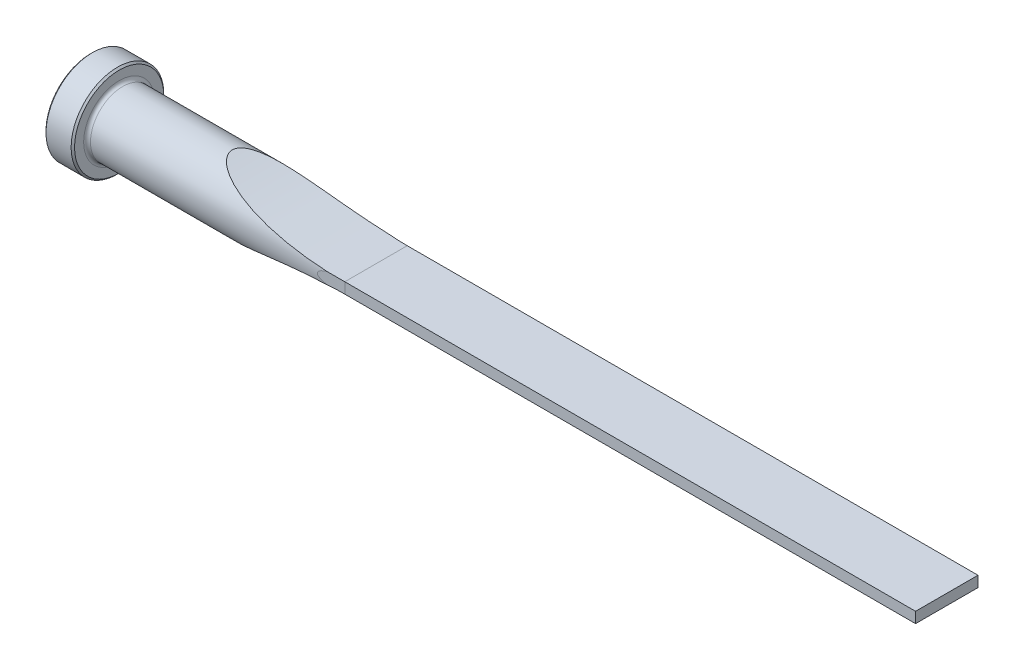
ISO-10303-21;
HEADER;
FILE_DESCRIPTION(('STEP AP214'),'2;1');
FILE_NAME('part.step','',(''),(''),'','','');
FILE_SCHEMA(('AUTOMOTIVE_DESIGN { 1 0 10303 214 1 1 1 1 }'));
ENDSEC;
DATA;
#1=APPLICATION_CONTEXT('core data for automotive mechanical design processes');
#2=APPLICATION_PROTOCOL_DEFINITION('international standard','automotive_design',2000,#1);
#3=PRODUCT_CONTEXT('',#1,'mechanical');
#4=PRODUCT('Part','Part','',(#3));
#5=PRODUCT_RELATED_PRODUCT_CATEGORY('part','',(#4));
#6=PRODUCT_DEFINITION_FORMATION('','',#4);
#7=PRODUCT_DEFINITION_CONTEXT('part definition',#1,'design');
#8=PRODUCT_DEFINITION('design','',#6,#7);
#9=PRODUCT_DEFINITION_SHAPE('','',#8);
#10=(LENGTH_UNIT() NAMED_UNIT(*) SI_UNIT(.MILLI.,.METRE.));
#11=(NAMED_UNIT(*) PLANE_ANGLE_UNIT() SI_UNIT($,.RADIAN.));
#12=(NAMED_UNIT(*) SI_UNIT($,.STERADIAN.) SOLID_ANGLE_UNIT());
#13=UNCERTAINTY_MEASURE_WITH_UNIT(LENGTH_MEASURE(1.E-05),#10,'distance_accuracy_value','');
#14=(GEOMETRIC_REPRESENTATION_CONTEXT(3) GLOBAL_UNCERTAINTY_ASSIGNED_CONTEXT((#13)) GLOBAL_UNIT_ASSIGNED_CONTEXT((#10,
#11,#12)) REPRESENTATION_CONTEXT('',''));
#15=CARTESIAN_POINT('',(0.,0.,0.));
#16=DIRECTION('',(0.,0.,1.));
#17=DIRECTION('',(1.,0.,0.));
#18=AXIS2_PLACEMENT_3D('',#15,#16,#17);
#19=CARTESIAN_POINT('',(0.,0.,0.));
#20=DIRECTION('',(-1.,0.,0.));
#21=DIRECTION('',(0.,0.,1.));
#22=AXIS2_PLACEMENT_3D('',#19,#20,#21);
#23=CYLINDRICAL_SURFACE('',#22,7.14375);
#24=CARTESIAN_POINT('',(7.112,0.,0.));
#25=DIRECTION('',(-1.,0.,0.));
#26=DIRECTION('',(0.,0.,1.));
#27=AXIS2_PLACEMENT_3D('',#24,#25,#26);
#28=CIRCLE('',#27,7.14375);
#29=CARTESIAN_POINT('',(7.112,0.,7.14375));
#30=VERTEX_POINT('',#29);
#31=EDGE_CURVE('E153',#30,#30,#28,.F.);
#32=ORIENTED_EDGE('',*,*,#31,.T.);
#33=EDGE_LOOP('',(#32));
#34=FACE_BOUND('',#33,.T.);
#35=CARTESIAN_POINT('',(63.5,1.66545622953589,6.94690000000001));
#36=CARTESIAN_POINT('',(63.2602205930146,1.66539130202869,6.9468983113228));
#37=CARTESIAN_POINT('',(63.0204291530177,1.66140650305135,6.94787008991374));
#38=CARTESIAN_POINT('',(62.5409765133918,1.64513557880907,6.95174989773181));
#39=CARTESIAN_POINT('',(62.3013155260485,1.63284358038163,6.95465929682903));
#40=CARTESIAN_POINT('',(61.8211110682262,1.59939046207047,6.96242801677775));
#41=CARTESIAN_POINT('',(61.5805715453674,1.57817397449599,6.96729950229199));
#42=CARTESIAN_POINT('',(61.100708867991,1.52578189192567,6.97895857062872));
#43=CARTESIAN_POINT('',(60.8613853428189,1.49460954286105,6.98574552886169));
#44=CARTESIAN_POINT('',(60.3341219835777,1.41275931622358,7.00282004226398));
#45=CARTESIAN_POINT('',(60.046591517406,1.35935208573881,7.01354421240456));
#46=CARTESIAN_POINT('',(59.6193276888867,1.26169102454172,7.03152533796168));
#47=CARTESIAN_POINT('',(59.4775502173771,1.22620337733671,7.03783632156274));
#48=CARTESIAN_POINT('',(59.1960773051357,1.14791266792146,7.05103266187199));
#49=CARTESIAN_POINT('',(59.0563810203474,1.10511266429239,7.05791777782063));
#50=CARTESIAN_POINT('',(58.7797072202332,1.00972668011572,7.07219584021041));
#51=CARTESIAN_POINT('',(58.6427427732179,0.957102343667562,7.07959070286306));
#52=CARTESIAN_POINT('',(58.3751712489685,0.838413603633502,7.09463865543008));
#53=CARTESIAN_POINT('',(58.2445402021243,0.772405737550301,7.10229054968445));
#54=CARTESIAN_POINT('',(58.0346934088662,0.642339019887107,7.11501322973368));
#55=CARTESIAN_POINT('',(57.952121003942,0.584056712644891,7.12014673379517));
#56=CARTESIAN_POINT('',(57.8379827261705,0.48446373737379,7.12738091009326));
#57=CARTESIAN_POINT('',(57.801394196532,0.449023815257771,7.12972544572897));
#58=CARTESIAN_POINT('',(57.7337306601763,0.373169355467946,7.13409783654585));
#59=CARTESIAN_POINT('',(57.7026400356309,0.332769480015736,7.13612658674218));
#60=CARTESIAN_POINT('',(57.6599545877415,0.263678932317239,7.13892891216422));
#61=CARTESIAN_POINT('',(57.6455334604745,0.236759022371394,7.13988012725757));
#62=CARTESIAN_POINT('',(57.6208913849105,0.181039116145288,7.14150989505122));
#63=CARTESIAN_POINT('',(57.610665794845,0.152241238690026,7.142188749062));
#64=CARTESIAN_POINT('',(57.5953440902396,0.0929451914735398,7.14320728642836));
#65=CARTESIAN_POINT('',(57.5903022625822,0.0624324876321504,7.14354337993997));
#66=CARTESIAN_POINT('',(57.5862149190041,0.00100805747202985,7.1438157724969));
#67=CARTESIAN_POINT('',(57.5871656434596,-0.0299034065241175,7.14375232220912));
#68=CARTESIAN_POINT('',(57.5944670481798,-0.0874662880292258,7.14326597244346));
#69=CARTESIAN_POINT('',(57.6001902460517,-0.114201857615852,7.14288484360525));
#70=CARTESIAN_POINT('',(57.6156498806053,-0.166474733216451,7.14185795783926));
#71=CARTESIAN_POINT('',(57.6253896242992,-0.192011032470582,7.14121198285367));
#72=CARTESIAN_POINT('',(57.6541940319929,-0.254728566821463,7.13930814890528));
#73=CARTESIAN_POINT('',(57.6754634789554,-0.29088512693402,7.13790755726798));
#74=CARTESIAN_POINT('',(57.7232657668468,-0.359496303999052,7.13478175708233));
#75=CARTESIAN_POINT('',(57.7498129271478,-0.39194046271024,7.13305566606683));
#76=CARTESIAN_POINT('',(57.8310525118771,-0.480375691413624,7.12781634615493));
#77=CARTESIAN_POINT('',(57.8901250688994,-0.53227243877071,7.12405564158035));
#78=CARTESIAN_POINT('',(58.0145571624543,-0.627749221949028,7.11627461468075));
#79=CARTESIAN_POINT('',(58.0799370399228,-0.671300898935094,7.11225346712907));
#80=CARTESIAN_POINT('',(58.2535094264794,-0.775899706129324,7.10178396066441));
#81=CARTESIAN_POINT('',(58.3644424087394,-0.83234654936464,7.09528710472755));
#82=CARTESIAN_POINT('',(58.590985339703,-0.935122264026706,7.08246694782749));
#83=CARTESIAN_POINT('',(58.7066056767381,-0.981427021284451,7.07614409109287));
#84=CARTESIAN_POINT('',(58.9416713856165,-1.06691744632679,7.06376189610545));
#85=CARTESIAN_POINT('',(59.0611424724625,-1.10603221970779,7.05770558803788));
#86=CARTESIAN_POINT('',(59.3017233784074,-1.17826382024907,7.04600484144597));
#87=CARTESIAN_POINT('',(59.4228312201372,-1.21138729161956,7.04035995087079));
#88=CARTESIAN_POINT('',(59.7104613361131,-1.28394915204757,7.02754987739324));
#89=CARTESIAN_POINT('',(59.8775128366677,-1.32131606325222,7.02057652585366));
#90=CARTESIAN_POINT('',(60.2131128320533,-1.38885630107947,7.00752462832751));
#91=CARTESIAN_POINT('',(60.3816617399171,-1.41902757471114,7.00144633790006));
#92=CARTESIAN_POINT('',(60.8894036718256,-1.50059649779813,6.98459356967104));
#93=CARTESIAN_POINT('',(61.2301123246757,-1.54291316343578,6.97522715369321));
#94=CARTESIAN_POINT('',(61.8927532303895,-1.60644233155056,6.96084942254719));
#95=CARTESIAN_POINT('',(62.2145799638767,-1.62877275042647,6.95560971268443));
#96=CARTESIAN_POINT('',(62.6971835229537,-1.65088759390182,6.9503801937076));
#97=CARTESIAN_POINT('',(62.8577023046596,-1.65636275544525,6.94907536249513));
#98=CARTESIAN_POINT('',(63.1788130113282,-1.66364180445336,6.94733518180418));
#99=CARTESIAN_POINT('',(63.3394049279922,-1.66544603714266,6.94689975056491));
#100=CARTESIAN_POINT('',(63.5,-1.66545622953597,6.9469));
#101=B_SPLINE_CURVE_WITH_KNOTS('',3,(#35,#36,#37,#38,#39,#40,#41,#42,#43,#44,#45,#46,#47,#48,
#49,#50,#51,#52,#53,#54,#55,#56,#57,#58,#59,#60,#61,#62,#63,#64,#65,#66,#67,#68,#69,#70,#71,#72,
#73,#74,#75,#76,#77,#78,#79,#80,#81,#82,#83,#84,#85,#86,#87,#88,#89,#90,#91,#92,#93,#94,#95,#96,
#97,#98,#99,#100),.UNSPECIFIED.,.F.,.F.,(4,2,2,2,2,2,2,2,2,2,2,2,2,2,2,2,2,2,2,2,2,2,2,2,2,2,2,
2,2,2,2,2,4),(0.,0.719321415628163,1.43915192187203,2.1635157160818,2.88764358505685,
3.76473487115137,4.20345743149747,4.64199693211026,5.08228579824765,5.52075206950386,
5.82287393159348,5.97551162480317,6.12770850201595,6.21909711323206,6.31038434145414,
6.40261812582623,6.49479405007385,6.57646960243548,6.65821253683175,6.78340264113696,
6.90893716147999,7.14377497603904,7.37939720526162,7.75236878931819,8.12621776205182,
8.50357546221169,8.88051208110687,9.39425854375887,9.90815140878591,10.9377202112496,
11.905257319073,12.3870700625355,12.8688374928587),.UNSPECIFIED.);
#102=CARTESIAN_POINT('',(59.6824678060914,1.27580380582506,7.02890380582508));
#103=VERTEX_POINT('',#102);
#104=CARTESIAN_POINT('',(59.682467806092,-1.27580380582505,7.02890380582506));
#105=VERTEX_POINT('',#104);
#106=EDGE_CURVE('E156',#103,#105,#101,.T.);
#107=ORIENTED_EDGE('',*,*,#106,.F.);
#108=CARTESIAN_POINT('',(63.5,1.19379999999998,7.04329508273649));
#109=CARTESIAN_POINT('',(62.9119073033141,1.19379905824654,7.04326293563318));
#110=CARTESIAN_POINT('',(62.3238139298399,1.19963550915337,7.04230480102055));
#111=CARTESIAN_POINT('',(61.147862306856,1.22297656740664,7.03830622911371));
#112=CARTESIAN_POINT('',(60.5600040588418,1.24048124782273,7.03526577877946));
#113=CARTESIAN_POINT('',(59.3842156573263,1.28717401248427,7.02686830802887));
#114=CARTESIAN_POINT('',(58.7962859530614,1.31637303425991,7.02150911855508));
#115=CARTESIAN_POINT('',(57.6211537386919,1.3864405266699,7.00801172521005));
#116=CARTESIAN_POINT('',(57.0339512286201,1.42730899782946,6.99987352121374));
#117=CARTESIAN_POINT('',(55.8411697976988,1.52223591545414,6.97985621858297));
#118=CARTESIAN_POINT('',(55.2356238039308,1.57668506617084,6.96786255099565));
#119=CARTESIAN_POINT('',(54.0258834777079,1.69798189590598,6.93930152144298));
#120=CARTESIAN_POINT('',(53.4216891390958,1.76482951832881,6.92273418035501));
#121=CARTESIAN_POINT('',(52.2154317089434,1.91082359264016,6.88386679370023));
#122=CARTESIAN_POINT('',(51.6133673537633,1.98996073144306,6.86157108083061));
#123=CARTESIAN_POINT('',(50.4112885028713,2.16050629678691,6.80979606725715));
#124=CARTESIAN_POINT('',(49.8112739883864,2.25191461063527,6.78031683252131));
#125=CARTESIAN_POINT('',(48.6130545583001,2.44702193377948,6.71237198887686));
#126=CARTESIAN_POINT('',(48.0148524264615,2.55073461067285,6.67389633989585));
#127=CARTESIAN_POINT('',(46.8214510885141,2.77024013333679,6.58581270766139));
#128=CARTESIAN_POINT('',(46.2262520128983,2.88603349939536,6.53620424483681));
#129=CARTESIAN_POINT('',(45.0380738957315,3.12980759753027,6.42305161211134));
#130=CARTESIAN_POINT('',(44.4451043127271,3.25781849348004,6.35947241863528));
#131=CARTESIAN_POINT('',(43.2639538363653,3.52545085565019,6.21510165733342));
#132=CARTESIAN_POINT('',(42.6757723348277,3.66507082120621,6.13431231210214));
#133=CARTESIAN_POINT('',(41.5131384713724,3.95355540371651,5.95242394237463));
#134=CARTESIAN_POINT('',(40.9386072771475,4.10227433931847,5.85160590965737));
#135=CARTESIAN_POINT('',(40.0826508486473,4.33293916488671,5.68048477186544));
#136=CARTESIAN_POINT('',(39.7982124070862,4.41111893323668,5.62010546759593));
#137=CARTESIAN_POINT('',(39.2316985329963,4.5698498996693,5.49181853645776));
#138=CARTESIAN_POINT('',(38.9496230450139,4.65040104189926,5.4239110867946));
#139=CARTESIAN_POINT('',(38.3895967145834,4.81330810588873,5.27986701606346));
#140=CARTESIAN_POINT('',(38.1116328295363,4.89565395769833,5.20376990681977));
#141=CARTESIAN_POINT('',(37.5590817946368,5.06226454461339,5.04183965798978));
#142=CARTESIAN_POINT('',(37.2844950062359,5.14652948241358,4.95600548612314));
#143=CARTESIAN_POINT('',(36.7398901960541,5.31651649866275,4.77319412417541));
#144=CARTESIAN_POINT('',(36.4698671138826,5.40223671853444,4.67623035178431));
#145=CARTESIAN_POINT('',(35.9352688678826,5.57472288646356,4.46920643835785));
#146=CARTESIAN_POINT('',(35.6706919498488,5.6614884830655,4.35915059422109));
#147=CARTESIAN_POINT('',(35.2934899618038,5.78711094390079,4.18888285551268));
#148=CARTESIAN_POINT('',(35.1780006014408,5.82584051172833,4.13489357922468));
#149=CARTESIAN_POINT('',(34.9486393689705,5.9032752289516,4.02356829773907));
#150=CARTESIAN_POINT('',(34.8347675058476,5.94198037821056,3.96623227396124));
#151=CARTESIAN_POINT('',(34.4957464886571,6.05797268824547,3.7886915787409));
#152=CARTESIAN_POINT('',(34.2733429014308,6.13508637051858,3.66302145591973));
#153=CARTESIAN_POINT('',(33.8400092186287,6.28719330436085,3.39528037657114));
#154=CARTESIAN_POINT('',(33.6290126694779,6.36219724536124,3.2533240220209));
#155=CARTESIAN_POINT('',(33.2211558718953,6.50882325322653,2.9490535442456));
#156=CARTESIAN_POINT('',(33.0242752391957,6.58045014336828,2.78676974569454));
#157=CARTESIAN_POINT('',(32.6993304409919,6.69985198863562,2.48282459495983));
#158=CARTESIAN_POINT('',(32.5666416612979,6.74900302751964,2.34669268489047));
#159=CARTESIAN_POINT('',(32.3164585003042,6.84228622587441,2.05893016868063));
#160=CARTESIAN_POINT('',(32.1989863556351,6.88641102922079,1.90727744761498));
#161=CARTESIAN_POINT('',(31.9841157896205,6.96755633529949,1.58560790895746));
#162=CARTESIAN_POINT('',(31.8869668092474,7.00448821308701,1.41539796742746));
#163=CARTESIAN_POINT('',(31.7229006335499,7.06709481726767,1.05911389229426));
#164=CARTESIAN_POINT('',(31.6558957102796,7.0928022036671,0.873087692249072));
#165=CARTESIAN_POINT('',(31.5725421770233,7.12483655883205,0.538927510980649));
#166=CARTESIAN_POINT('',(31.5476265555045,7.13443643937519,0.393250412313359));
#167=CARTESIAN_POINT('',(31.5213405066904,7.14456514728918,0.0994665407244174));
#168=CARTESIAN_POINT('',(31.5199580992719,7.14509859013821,-0.0486389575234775));
#169=CARTESIAN_POINT('',(31.5408681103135,7.13704021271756,-0.342727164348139));
#170=CARTESIAN_POINT('',(31.5631380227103,7.12845706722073,-0.488711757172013));
#171=CARTESIAN_POINT('',(31.6292179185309,7.10305066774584,-0.774951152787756));
#172=CARTESIAN_POINT('',(31.673045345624,7.08622074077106,-0.915201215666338));
#173=CARTESIAN_POINT('',(31.7990758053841,7.03799063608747,-1.23934078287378));
#174=CARTESIAN_POINT('',(31.8895352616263,7.00348317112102,-1.41953152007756));
#175=CARTESIAN_POINT('',(32.0960814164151,6.92519979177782,-1.76236227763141));
#176=CARTESIAN_POINT('',(32.212230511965,6.88140132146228,-1.92495810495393));
#177=CARTESIAN_POINT('',(32.4418899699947,6.79544293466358,-2.20751319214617));
#178=CARTESIAN_POINT('',(32.552627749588,6.75422152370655,-2.3300664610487));
#179=CARTESIAN_POINT('',(32.7838482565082,6.66872452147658,-2.56454034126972));
#180=CARTESIAN_POINT('',(32.9043379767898,6.62444674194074,-2.67645319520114));
#181=CARTESIAN_POINT('',(33.1529845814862,6.53372451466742,-2.89087879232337));
#182=CARTESIAN_POINT('',(33.2811551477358,6.4872762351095,-2.99337388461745));
#183=CARTESIAN_POINT('',(33.5433224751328,6.39298230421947,-3.18979651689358));
#184=CARTESIAN_POINT('',(33.6773180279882,6.34513694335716,-3.28372582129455));
#185=CARTESIAN_POINT('',(33.9575388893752,6.24586449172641,-3.46900486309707));
#186=CARTESIAN_POINT('',(34.1040302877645,6.19438593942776,-3.55992249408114));
#187=CARTESIAN_POINT('',(34.4012101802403,6.09085223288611,-3.73429297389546));
#188=CARTESIAN_POINT('',(34.5518996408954,6.03879694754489,-3.81774408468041));
#189=CARTESIAN_POINT('',(35.0093003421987,5.88219893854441,-4.05828445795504));
#190=CARTESIAN_POINT('',(35.321133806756,5.7772986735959,-4.20542598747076));
#191=CARTESIAN_POINT('',(35.9548917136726,5.56813043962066,-4.47869136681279));
#192=CARTESIAN_POINT('',(36.2768390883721,5.46386466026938,-4.6047626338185));
#193=CARTESIAN_POINT('',(36.7648386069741,5.30895287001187,-4.78061129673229));
#194=CARTESIAN_POINT('',(36.9283148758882,5.25757459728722,-4.8370068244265));
#195=CARTESIAN_POINT('',(37.2567824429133,5.15539227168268,-4.94577280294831));
#196=CARTESIAN_POINT('',(37.4217737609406,5.10458822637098,-4.99814320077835));
#197=CARTESIAN_POINT('',(37.8630484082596,4.97012695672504,-5.13275163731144));
#198=CARTESIAN_POINT('',(38.1405023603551,4.88704914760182,-5.21173805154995));
#199=CARTESIAN_POINT('',(38.6984082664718,4.7229875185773,-5.36086103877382));
#200=CARTESIAN_POINT('',(38.9788605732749,4.64200394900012,-5.43099655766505));
#201=CARTESIAN_POINT('',(39.5423543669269,4.48231127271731,-5.56352607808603));
#202=CARTESIAN_POINT('',(39.8253968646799,4.40360310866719,-5.62591690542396));
#203=CARTESIAN_POINT('',(40.3935836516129,4.2486471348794,-5.7438333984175));
#204=CARTESIAN_POINT('',(40.6787280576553,4.17239946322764,-5.79935867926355));
#205=CARTESIAN_POINT('',(41.5379336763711,3.94724726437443,-5.95702465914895));
#206=CARTESIAN_POINT('',(42.1147081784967,3.80223400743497,-6.05001309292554));
#207=CARTESIAN_POINT('',(43.2735076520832,3.52328392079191,-6.21658559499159));
#208=CARTESIAN_POINT('',(43.8555315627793,3.38934490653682,-6.29017349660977));
#209=CARTESIAN_POINT('',(45.0268020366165,3.13224368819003,-6.42208589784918));
#210=CARTESIAN_POINT('',(45.6160702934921,3.00913989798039,-6.4803306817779));
#211=CARTESIAN_POINT('',(46.7980712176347,2.77473768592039,-6.58410257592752));
#212=CARTESIAN_POINT('',(47.3908040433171,2.66343980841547,-6.62962909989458));
#213=CARTESIAN_POINT('',(48.5784639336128,2.4529356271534,-6.71036185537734));
#214=CARTESIAN_POINT('',(49.1733880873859,2.35371691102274,-6.74557873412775));
#215=CARTESIAN_POINT('',(50.3655343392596,2.16735463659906,-6.80774441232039));
#216=CARTESIAN_POINT('',(50.9627563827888,2.08021079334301,-6.83469340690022));
#217=CARTESIAN_POINT('',(52.0581625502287,1.93175513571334,-6.8779647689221));
#218=CARTESIAN_POINT('',(52.5560536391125,1.86856568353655,-6.89531294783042));
#219=CARTESIAN_POINT('',(53.5529617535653,1.75061482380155,-6.92619886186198));
#220=CARTESIAN_POINT('',(54.0519788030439,1.69585359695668,-6.93973651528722));
#221=CARTESIAN_POINT('',(55.0510469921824,1.59477550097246,-6.96365934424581));
#222=CARTESIAN_POINT('',(55.5510983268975,1.5484604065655,-6.97404385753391));
#223=CARTESIAN_POINT('',(56.5519614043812,1.46430737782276,-6.99219710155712));
#224=CARTESIAN_POINT('',(57.0527731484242,1.42646945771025,-6.99996582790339));
#225=CARTESIAN_POINT('',(58.0486959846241,1.35970720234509,-7.01323780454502));
#226=CARTESIAN_POINT('',(58.5437996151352,1.33067681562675,-7.0187683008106));
#227=CARTESIAN_POINT('',(59.53443970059,1.28090513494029,-7.0280212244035));
#228=CARTESIAN_POINT('',(60.0299761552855,1.26016383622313,-7.03174365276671));
#229=CARTESIAN_POINT('',(61.0211897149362,1.22698210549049,-7.03761174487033));
#230=CARTESIAN_POINT('',(61.5168667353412,1.21453922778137,-7.03975787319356));
#231=CARTESIAN_POINT('',(62.5083626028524,1.19794794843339,-7.04259142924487));
#232=CARTESIAN_POINT('',(63.0041814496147,1.19379952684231,-7.04327886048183));
#233=CARTESIAN_POINT('',(63.5,1.19379999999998,-7.04329508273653));
#234=B_SPLINE_CURVE_WITH_KNOTS('',3,(#108,#109,#110,#111,#112,#113,#114,#115,#116,#117,#118,
#119,#120,#121,#122,#123,#124,#125,#126,#127,#128,#129,#130,#131,#132,#133,#134,#135,#136,#137,
#138,#139,#140,#141,#142,#143,#144,#145,#146,#147,#148,#149,#150,#151,#152,#153,#154,#155,#156,
#157,#158,#159,#160,#161,#162,#163,#164,#165,#166,#167,#168,#169,#170,#171,#172,#173,#174,#175,
#176,#177,#178,#179,#180,#181,#182,#183,#184,#185,#186,#187,#188,#189,#190,#191,#192,#193,#194,
#195,#196,#197,#198,#199,#200,#201,#202,#203,#204,#205,#206,#207,#208,#209,#210,#211,#212,#213,
#214,#215,#216,#217,#218,#219,#220,#221,#222,#223,#224,#225,#226,#227,#228,#229,#230,#231,#232,
#233),.UNSPECIFIED.,.F.,.F.,(4,2,2,2,2,2,2,2,2,2,2,2,2,2,2,2,2,2,2,2,2,2,2,2,2,2,2,2,2,2,2,2,2,
2,2,2,2,2,2,2,2,2,2,2,2,2,2,2,2,2,2,2,2,2,2,2,2,2,2,2,2,2,4),(0.,1.76424942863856,
3.52850990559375,5.29442433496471,7.0603388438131,8.88451857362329,10.708689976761,
12.5314856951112,14.3542646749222,16.1790876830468,18.003989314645,19.8335191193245,
21.6628127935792,23.4680553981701,24.3712738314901,25.2744710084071,26.1734909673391,
27.0726063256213,27.9706488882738,28.8683975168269,29.2680687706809,29.6677422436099,
30.4676066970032,31.2621529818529,32.0555277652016,32.643612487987,33.2325471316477,
33.8283335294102,34.422374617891,34.8646952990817,35.3067908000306,35.7484660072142,
36.1904991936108,36.8007129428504,37.412425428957,37.9224233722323,38.4327903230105,
38.9440950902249,39.4552942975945,39.9948499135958,40.5345308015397,41.6146714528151,
42.6974686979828,43.2386284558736,43.7797953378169,44.680212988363,45.5807377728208,
46.4816304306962,47.3825735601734,49.1878382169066,50.9927459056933,52.8068539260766,
54.6210455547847,56.4333569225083,58.2456255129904,59.7520940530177,61.2585948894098,
62.7654119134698,64.2722314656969,65.7601128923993,67.2479934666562,68.7354353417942,
70.2228736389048),.UNSPECIFIED.);
#235=CARTESIAN_POINT('',(59.6824678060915,1.27580380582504,-7.02890380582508));
#236=VERTEX_POINT('',#235);
#237=EDGE_CURVE('E106',#103,#236,#234,.T.);
#238=ORIENTED_EDGE('',*,*,#237,.T.);
#239=CARTESIAN_POINT('',(63.5,1.66545622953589,-6.94690000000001));
#240=CARTESIAN_POINT('',(63.2602205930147,1.66539130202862,-6.94689831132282));
#241=CARTESIAN_POINT('',(63.0204291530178,1.66140650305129,-6.94787008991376));
#242=CARTESIAN_POINT('',(62.540976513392,1.64513557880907,-6.95174989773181));
#243=CARTESIAN_POINT('',(62.3013155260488,1.63284358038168,-6.95465929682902));
#244=CARTESIAN_POINT('',(61.8211110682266,1.59939046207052,-6.96242801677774));
#245=CARTESIAN_POINT('',(61.5805715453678,1.57817397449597,-6.96729950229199));
#246=CARTESIAN_POINT('',(61.1007088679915,1.52578189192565,-6.97895857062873));
#247=CARTESIAN_POINT('',(60.8613853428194,1.49460954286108,-6.98574552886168));
#248=CARTESIAN_POINT('',(60.3341219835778,1.4127593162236,-7.00282004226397));
#249=CARTESIAN_POINT('',(60.0465915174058,1.35935208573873,-7.01354421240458));
#250=CARTESIAN_POINT('',(59.6193276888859,1.2616910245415,-7.03152533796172));
#251=CARTESIAN_POINT('',(59.4775502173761,1.22620337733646,-7.03783632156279));
#252=CARTESIAN_POINT('',(59.1960773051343,1.1479126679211,-7.05103266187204));
#253=CARTESIAN_POINT('',(59.0563810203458,1.10511266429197,-7.0579177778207));
#254=CARTESIAN_POINT('',(58.7797072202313,1.00972668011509,-7.0721958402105));
#255=CARTESIAN_POINT('',(58.6427427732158,0.957102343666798,-7.07959070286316));
#256=CARTESIAN_POINT('',(58.3751712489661,0.83841360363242,-7.09463865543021));
#257=CARTESIAN_POINT('',(58.2445402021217,0.772405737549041,-7.10229054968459));
#258=CARTESIAN_POINT('',(58.0346934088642,0.642339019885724,-7.1150132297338));
#259=CARTESIAN_POINT('',(57.9521210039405,0.584056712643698,-7.12014673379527));
#260=CARTESIAN_POINT('',(57.8379827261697,0.484463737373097,-7.12738091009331));
#261=CARTESIAN_POINT('',(57.8013941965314,0.449023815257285,-7.129725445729));
#262=CARTESIAN_POINT('',(57.7337306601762,0.373169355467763,-7.13409783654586));
#263=CARTESIAN_POINT('',(57.7026400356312,0.332769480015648,-7.13612658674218));
#264=CARTESIAN_POINT('',(57.6599545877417,0.263678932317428,-7.13892891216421));
#265=CARTESIAN_POINT('',(57.6455334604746,0.236759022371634,-7.13988012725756));
#266=CARTESIAN_POINT('',(57.6208913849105,0.181039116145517,-7.14150989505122));
#267=CARTESIAN_POINT('',(57.610665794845,0.152241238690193,-7.142188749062));
#268=CARTESIAN_POINT('',(57.5953440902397,0.0929451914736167,-7.14320728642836));
#269=CARTESIAN_POINT('',(57.5903022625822,0.0624324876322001,-7.14354337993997));
#270=CARTESIAN_POINT('',(57.5862149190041,0.00100805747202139,-7.14381577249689));
#271=CARTESIAN_POINT('',(57.5871656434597,-0.029903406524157,-7.14375232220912));
#272=CARTESIAN_POINT('',(57.5944670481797,-0.0874662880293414,-7.14326597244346));
#273=CARTESIAN_POINT('',(57.6001902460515,-0.114201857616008,-7.14288484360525));
#274=CARTESIAN_POINT('',(57.6156498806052,-0.166474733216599,-7.14185795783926));
#275=CARTESIAN_POINT('',(57.6253896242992,-0.192011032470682,-7.14121198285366));
#276=CARTESIAN_POINT('',(57.654194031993,-0.254728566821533,-7.13930814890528));
#277=CARTESIAN_POINT('',(57.6754634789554,-0.290885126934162,-7.13790755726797));
#278=CARTESIAN_POINT('',(57.7232657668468,-0.359496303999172,-7.13478175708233));
#279=CARTESIAN_POINT('',(57.7498129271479,-0.391940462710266,-7.13305566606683));
#280=CARTESIAN_POINT('',(57.8310525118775,-0.480375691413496,-7.12781634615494));
#281=CARTESIAN_POINT('',(57.8901250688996,-0.532272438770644,-7.12405564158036));
#282=CARTESIAN_POINT('',(58.0145571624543,-0.627749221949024,-7.11627461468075));
#283=CARTESIAN_POINT('',(58.0799370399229,-0.67130089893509,-7.11225346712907));
#284=CARTESIAN_POINT('',(58.2535094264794,-0.775899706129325,-7.10178396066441));
#285=CARTESIAN_POINT('',(58.3644424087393,-0.832346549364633,-7.09528710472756));
#286=CARTESIAN_POINT('',(58.5909853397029,-0.93512226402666,-7.0824669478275));
#287=CARTESIAN_POINT('',(58.7066056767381,-0.981427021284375,-7.07614409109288));
#288=CARTESIAN_POINT('',(58.9416713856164,-1.06691744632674,-7.06376189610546));
#289=CARTESIAN_POINT('',(59.0611424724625,-1.10603221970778,-7.05770558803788));
#290=CARTESIAN_POINT('',(59.3017233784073,-1.17826382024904,-7.04600484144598));
#291=CARTESIAN_POINT('',(59.4228312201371,-1.21138729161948,-7.04035995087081));
#292=CARTESIAN_POINT('',(59.7104613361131,-1.28394915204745,-7.02754987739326));
#293=CARTESIAN_POINT('',(59.8775128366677,-1.32131606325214,-7.02057652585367));
#294=CARTESIAN_POINT('',(60.2131128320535,-1.38885630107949,-7.00752462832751));
#295=CARTESIAN_POINT('',(60.3816617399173,-1.41902757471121,-7.00144633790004));
#296=CARTESIAN_POINT('',(60.889403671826,-1.50059649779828,-6.98459356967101));
#297=CARTESIAN_POINT('',(61.2301123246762,-1.54291316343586,-6.9752271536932));
#298=CARTESIAN_POINT('',(61.89275323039,-1.60644233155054,-6.9608494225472));
#299=CARTESIAN_POINT('',(62.2145799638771,-1.62877275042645,-6.95560971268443));
#300=CARTESIAN_POINT('',(62.6971835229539,-1.65088759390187,-6.95038019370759));
#301=CARTESIAN_POINT('',(62.8577023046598,-1.65636275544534,-6.94907536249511));
#302=CARTESIAN_POINT('',(63.1788130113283,-1.66364180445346,-6.94733518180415));
#303=CARTESIAN_POINT('',(63.3394049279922,-1.66544603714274,-6.94689975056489));
#304=CARTESIAN_POINT('',(63.5,-1.66545622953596,-6.9469));
#305=B_SPLINE_CURVE_WITH_KNOTS('',3,(#239,#240,#241,#242,#243,#244,#245,#246,#247,#248,#249,
#250,#251,#252,#253,#254,#255,#256,#257,#258,#259,#260,#261,#262,#263,#264,#265,#266,#267,#268,
#269,#270,#271,#272,#273,#274,#275,#276,#277,#278,#279,#280,#281,#282,#283,#284,#285,#286,#287,
#288,#289,#290,#291,#292,#293,#294,#295,#296,#297,#298,#299,#300,#301,#302,#303,#304),
.UNSPECIFIED.,.F.,.F.,(4,2,2,2,2,2,2,2,2,2,2,2,2,2,2,2,2,2,2,2,2,2,2,2,2,2,2,2,2,2,2,2,4),(0.,
0.719321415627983,1.43915192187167,2.1635157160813,2.88764358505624,3.76473487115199,
4.20345743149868,4.64199693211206,5.08228579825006,5.52075206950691,5.82287393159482,
5.97551162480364,6.1277085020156,6.21909711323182,6.31038434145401,6.40261812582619,
6.49479405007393,6.57646960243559,6.65821253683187,6.78340264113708,6.90893716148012,
7.1437749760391,7.37939720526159,7.75236878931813,8.12621776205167,8.50357546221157,
8.88051208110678,9.39425854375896,9.90815140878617,10.9377202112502,11.9052573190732,
12.3870700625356,12.8688374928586),.UNSPECIFIED.);
#306=CARTESIAN_POINT('',(59.682467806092,-1.27580380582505,-7.02890380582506));
#307=VERTEX_POINT('',#306);
#308=EDGE_CURVE('E175',#236,#307,#305,.T.);
#309=ORIENTED_EDGE('',*,*,#308,.T.);
#310=CARTESIAN_POINT('',(63.5,-1.19379999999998,7.04329508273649));
#311=CARTESIAN_POINT('',(62.9119073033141,-1.19379905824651,7.04326293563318));
#312=CARTESIAN_POINT('',(62.3238139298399,-1.19963550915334,7.04230480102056));
#313=CARTESIAN_POINT('',(61.147862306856,-1.22297656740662,7.03830622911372));
#314=CARTESIAN_POINT('',(60.5600040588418,-1.24048124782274,7.03526577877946));
#315=CARTESIAN_POINT('',(59.3842156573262,-1.28717401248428,7.02686830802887));
#316=CARTESIAN_POINT('',(58.7962859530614,-1.31637303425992,7.02150911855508));
#317=CARTESIAN_POINT('',(57.6211537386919,-1.38644052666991,7.00801172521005));
#318=CARTESIAN_POINT('',(57.03395122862,-1.42730899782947,6.99987352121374));
#319=CARTESIAN_POINT('',(55.8411697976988,-1.52223591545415,6.97985621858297));
#320=CARTESIAN_POINT('',(55.2356238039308,-1.57668506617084,6.96786255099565));
#321=CARTESIAN_POINT('',(54.0258834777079,-1.69798189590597,6.93930152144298));
#322=CARTESIAN_POINT('',(53.4216891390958,-1.76482951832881,6.92273418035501));
#323=CARTESIAN_POINT('',(52.2154317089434,-1.91082359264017,6.88386679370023));
#324=CARTESIAN_POINT('',(51.6133673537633,-1.98996073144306,6.86157108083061));
#325=CARTESIAN_POINT('',(50.4112885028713,-2.16050629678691,6.80979606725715));
#326=CARTESIAN_POINT('',(49.8112739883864,-2.25191461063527,6.78031683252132));
#327=CARTESIAN_POINT('',(48.6130545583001,-2.44702193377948,6.71237198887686));
#328=CARTESIAN_POINT('',(48.0148524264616,-2.55073461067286,6.67389633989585));
#329=CARTESIAN_POINT('',(46.8214510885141,-2.77024013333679,6.58581270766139));
#330=CARTESIAN_POINT('',(46.2262520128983,-2.88603349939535,6.53620424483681));
#331=CARTESIAN_POINT('',(45.0380738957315,-3.12980759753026,6.42305161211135));
#332=CARTESIAN_POINT('',(44.4451043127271,-3.25781849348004,6.35947241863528));
#333=CARTESIAN_POINT('',(43.2639538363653,-3.5254508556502,6.21510165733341));
#334=CARTESIAN_POINT('',(42.6757723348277,-3.6650708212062,6.13431231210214));
#335=CARTESIAN_POINT('',(41.5131384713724,-3.95355540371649,5.95242394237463));
#336=CARTESIAN_POINT('',(40.9386072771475,-4.10227433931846,5.85160590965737));
#337=CARTESIAN_POINT('',(40.0826508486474,-4.3329391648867,5.68048477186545));
#338=CARTESIAN_POINT('',(39.7982124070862,-4.41111893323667,5.62010546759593));
#339=CARTESIAN_POINT('',(39.2316985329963,-4.56984989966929,5.49181853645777));
#340=CARTESIAN_POINT('',(38.9496230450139,-4.65040104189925,5.42391108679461));
#341=CARTESIAN_POINT('',(38.3895967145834,-4.81330810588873,5.27986701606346));
#342=CARTESIAN_POINT('',(38.1116328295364,-4.89565395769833,5.20376990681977));
#343=CARTESIAN_POINT('',(37.5590817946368,-5.06226454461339,5.04183965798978));
#344=CARTESIAN_POINT('',(37.284495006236,-5.14652948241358,4.95600548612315));
#345=CARTESIAN_POINT('',(36.7398901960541,-5.31651649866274,4.77319412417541));
#346=CARTESIAN_POINT('',(36.4698671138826,-5.40223671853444,4.67623035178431));
#347=CARTESIAN_POINT('',(35.9352688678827,-5.57472288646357,4.46920643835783));
#348=CARTESIAN_POINT('',(35.6706919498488,-5.66148848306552,4.35915059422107));
#349=CARTESIAN_POINT('',(35.2934899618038,-5.78711094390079,4.18888285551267));
#350=CARTESIAN_POINT('',(35.1780006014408,-5.82584051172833,4.13489357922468));
#351=CARTESIAN_POINT('',(34.9486393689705,-5.90327522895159,4.02356829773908));
#352=CARTESIAN_POINT('',(34.8347675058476,-5.94198037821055,3.96623227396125));
#353=CARTESIAN_POINT('',(34.4957464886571,-6.05797268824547,3.78869157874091));
#354=CARTESIAN_POINT('',(34.2733429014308,-6.13508637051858,3.66302145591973));
#355=CARTESIAN_POINT('',(33.8400092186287,-6.28719330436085,3.39528037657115));
#356=CARTESIAN_POINT('',(33.6290126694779,-6.36219724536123,3.25332402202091));
#357=CARTESIAN_POINT('',(33.2211558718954,-6.50882325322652,2.94905354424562));
#358=CARTESIAN_POINT('',(33.0242752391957,-6.58045014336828,2.78676974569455));
#359=CARTESIAN_POINT('',(32.6993304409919,-6.69985198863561,2.48282459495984));
#360=CARTESIAN_POINT('',(32.5666416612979,-6.74900302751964,2.34669268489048));
#361=CARTESIAN_POINT('',(32.3164585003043,-6.84228622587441,2.05893016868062));
#362=CARTESIAN_POINT('',(32.1989863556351,-6.88641102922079,1.90727744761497));
#363=CARTESIAN_POINT('',(31.9841157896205,-6.96755633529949,1.58560790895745));
#364=CARTESIAN_POINT('',(31.8869668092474,-7.00448821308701,1.41539796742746));
#365=CARTESIAN_POINT('',(31.7229006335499,-7.06709481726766,1.05911389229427));
#366=CARTESIAN_POINT('',(31.6558957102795,-7.0928022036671,0.873087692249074));
#367=CARTESIAN_POINT('',(31.5725421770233,-7.12483655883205,0.53892751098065));
#368=CARTESIAN_POINT('',(31.5476265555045,-7.13443643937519,0.393250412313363));
#369=CARTESIAN_POINT('',(31.5213405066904,-7.14456514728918,0.0994665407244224));
#370=CARTESIAN_POINT('',(31.5199580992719,-7.14509859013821,-0.0486389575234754));
#371=CARTESIAN_POINT('',(31.5408681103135,-7.13704021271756,-0.342727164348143));
#372=CARTESIAN_POINT('',(31.5631380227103,-7.12845706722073,-0.48871175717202));
#373=CARTESIAN_POINT('',(31.6292179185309,-7.10305066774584,-0.774951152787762));
#374=CARTESIAN_POINT('',(31.673045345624,-7.08622074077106,-0.915201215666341));
#375=CARTESIAN_POINT('',(31.7990758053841,-7.03799063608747,-1.23934078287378));
#376=CARTESIAN_POINT('',(31.8895352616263,-7.00348317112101,-1.41953152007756));
#377=CARTESIAN_POINT('',(32.0960814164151,-6.92519979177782,-1.76236227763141));
#378=CARTESIAN_POINT('',(32.212230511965,-6.88140132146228,-1.92495810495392));
#379=CARTESIAN_POINT('',(32.4418899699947,-6.79544293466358,-2.20751319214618));
#380=CARTESIAN_POINT('',(32.552627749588,-6.75422152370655,-2.33006646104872));
#381=CARTESIAN_POINT('',(32.7838482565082,-6.66872452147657,-2.56454034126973));
#382=CARTESIAN_POINT('',(32.9043379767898,-6.62444674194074,-2.67645319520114));
#383=CARTESIAN_POINT('',(33.1529845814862,-6.53372451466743,-2.89087879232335));
#384=CARTESIAN_POINT('',(33.2811551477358,-6.48727623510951,-2.99337388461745));
#385=CARTESIAN_POINT('',(33.5433224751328,-6.39298230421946,-3.18979651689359));
#386=CARTESIAN_POINT('',(33.6773180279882,-6.34513694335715,-3.28372582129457));
#387=CARTESIAN_POINT('',(33.9575388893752,-6.2458644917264,-3.46900486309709));
#388=CARTESIAN_POINT('',(34.1040302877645,-6.19438593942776,-3.55992249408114));
#389=CARTESIAN_POINT('',(34.4012101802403,-6.09085223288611,-3.73429297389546));
#390=CARTESIAN_POINT('',(34.5518996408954,-6.03879694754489,-3.8177440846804));
#391=CARTESIAN_POINT('',(35.0093003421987,-5.88219893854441,-4.05828445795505));
#392=CARTESIAN_POINT('',(35.321133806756,-5.7772986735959,-4.20542598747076));
#393=CARTESIAN_POINT('',(35.9548917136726,-5.56813043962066,-4.4786913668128));
#394=CARTESIAN_POINT('',(36.2768390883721,-5.46386466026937,-4.60476263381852));
#395=CARTESIAN_POINT('',(36.7648386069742,-5.30895287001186,-4.78061129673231));
#396=CARTESIAN_POINT('',(36.9283148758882,-5.2575745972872,-4.83700682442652));
#397=CARTESIAN_POINT('',(37.2567824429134,-5.15539227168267,-4.94577280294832));
#398=CARTESIAN_POINT('',(37.4217737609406,-5.10458822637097,-4.99814320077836));
#399=CARTESIAN_POINT('',(37.8630484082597,-4.97012695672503,-5.13275163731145));
#400=CARTESIAN_POINT('',(38.1405023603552,-4.8870491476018,-5.21173805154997));
#401=CARTESIAN_POINT('',(38.6984082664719,-4.72298751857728,-5.36086103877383));
#402=CARTESIAN_POINT('',(38.9788605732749,-4.64200394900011,-5.43099655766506));
#403=CARTESIAN_POINT('',(39.5423543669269,-4.48231127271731,-5.56352607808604));
#404=CARTESIAN_POINT('',(39.8253968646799,-4.40360310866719,-5.62591690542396));
#405=CARTESIAN_POINT('',(40.393583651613,-4.24864713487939,-5.74383339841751));
#406=CARTESIAN_POINT('',(40.6787280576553,-4.17239946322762,-5.79935867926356));
#407=CARTESIAN_POINT('',(41.5379336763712,-3.94724726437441,-5.95702465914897));
#408=CARTESIAN_POINT('',(42.1147081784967,-3.80223400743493,-6.05001309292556));
#409=CARTESIAN_POINT('',(43.2735076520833,-3.52328392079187,-6.21658559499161));
#410=CARTESIAN_POINT('',(43.8555315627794,-3.38934490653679,-6.29017349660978));
#411=CARTESIAN_POINT('',(45.0268020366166,-3.13224368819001,-6.42208589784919));
#412=CARTESIAN_POINT('',(45.6160702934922,-3.00913989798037,-6.4803306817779));
#413=CARTESIAN_POINT('',(46.7980712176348,-2.77473768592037,-6.58410257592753));
#414=CARTESIAN_POINT('',(47.3908040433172,-2.66343980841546,-6.62962909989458));
#415=CARTESIAN_POINT('',(48.5784639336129,-2.45293562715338,-6.71036185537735));
#416=CARTESIAN_POINT('',(49.173388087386,-2.35371691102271,-6.74557873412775));
#417=CARTESIAN_POINT('',(50.3655343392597,-2.16735463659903,-6.8077444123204));
#418=CARTESIAN_POINT('',(50.9627563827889,-2.08021079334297,-6.83469340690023));
#419=CARTESIAN_POINT('',(52.0581625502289,-1.93175513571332,-6.87796476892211));
#420=CARTESIAN_POINT('',(52.5560536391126,-1.86856568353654,-6.89531294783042));
#421=CARTESIAN_POINT('',(53.5529617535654,-1.75061482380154,-6.92619886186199));
#422=CARTESIAN_POINT('',(54.051978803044,-1.69585359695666,-6.93973651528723));
#423=CARTESIAN_POINT('',(55.0510469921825,-1.59477550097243,-6.96365934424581));
#424=CARTESIAN_POINT('',(55.5510983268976,-1.54846040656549,-6.97404385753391));
#425=CARTESIAN_POINT('',(56.5519614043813,-1.46430737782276,-6.99219710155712));
#426=CARTESIAN_POINT('',(57.0527731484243,-1.42646945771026,-6.99996582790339));
#427=CARTESIAN_POINT('',(58.0486959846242,-1.3597072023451,-7.01323780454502));
#428=CARTESIAN_POINT('',(58.5437996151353,-1.33067681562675,-7.0187683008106));
#429=CARTESIAN_POINT('',(59.5344397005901,-1.28090513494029,-7.0280212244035));
#430=CARTESIAN_POINT('',(60.0299761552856,-1.26016383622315,-7.03174365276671));
#431=CARTESIAN_POINT('',(61.0211897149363,-1.2269821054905,-7.03761174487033));
#432=CARTESIAN_POINT('',(61.5168667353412,-1.21453922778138,-7.03975787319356));
#433=CARTESIAN_POINT('',(62.5083626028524,-1.19794794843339,-7.04259142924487));
#434=CARTESIAN_POINT('',(63.0041814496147,-1.1937995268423,-7.04327886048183));
#435=CARTESIAN_POINT('',(63.5,-1.19379999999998,-7.04329508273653));
#436=B_SPLINE_CURVE_WITH_KNOTS('',3,(#310,#311,#312,#313,#314,#315,#316,#317,#318,#319,#320,
#321,#322,#323,#324,#325,#326,#327,#328,#329,#330,#331,#332,#333,#334,#335,#336,#337,#338,#339,
#340,#341,#342,#343,#344,#345,#346,#347,#348,#349,#350,#351,#352,#353,#354,#355,#356,#357,#358,
#359,#360,#361,#362,#363,#364,#365,#366,#367,#368,#369,#370,#371,#372,#373,#374,#375,#376,#377,
#378,#379,#380,#381,#382,#383,#384,#385,#386,#387,#388,#389,#390,#391,#392,#393,#394,#395,#396,
#397,#398,#399,#400,#401,#402,#403,#404,#405,#406,#407,#408,#409,#410,#411,#412,#413,#414,#415,
#416,#417,#418,#419,#420,#421,#422,#423,#424,#425,#426,#427,#428,#429,#430,#431,#432,#433,#434,
#435),.UNSPECIFIED.,.F.,.F.,(4,2,2,2,2,2,2,2,2,2,2,2,2,2,2,2,2,2,2,2,2,2,2,2,2,2,2,2,2,2,2,2,2,
2,2,2,2,2,2,2,2,2,2,2,2,2,2,2,2,2,2,2,2,2,2,2,2,2,2,2,2,2,4),(0.,1.76424942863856,
3.52850990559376,5.29442433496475,7.06033884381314,8.88451857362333,10.7086899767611,
12.5314856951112,14.3542646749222,16.1790876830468,18.003989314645,19.8335191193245,
21.6628127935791,23.4680553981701,24.3712738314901,25.2744710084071,26.1734909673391,
27.0726063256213,27.9706488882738,28.8683975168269,29.2680687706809,29.6677422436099,
30.4676066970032,31.2621529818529,32.0555277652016,32.643612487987,33.2325471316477,
33.8283335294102,34.422374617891,34.8646952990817,35.3067908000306,35.7484660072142,
36.1904991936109,36.8007129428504,37.412425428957,37.9224233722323,38.4327903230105,
38.9440950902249,39.4552942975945,39.9948499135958,40.5345308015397,41.6146714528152,
42.6974686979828,43.2386284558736,43.7797953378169,44.680212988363,45.5807377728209,
46.4816304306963,47.3825735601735,49.1878382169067,50.9927459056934,52.8068539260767,
54.6210455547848,56.4333569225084,58.2456255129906,59.7520940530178,61.25859488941,
62.76541191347,64.272231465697,65.7601128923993,67.2479934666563,68.7354353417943,
70.2228736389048),.UNSPECIFIED.);
#437=EDGE_CURVE('E105',#105,#307,#436,.T.);
#438=ORIENTED_EDGE('',*,*,#437,.F.);
#439=EDGE_LOOP('',(#107,#238,#309,#438));
#440=FACE_BOUND('',#439,.T.);
#441=ADVANCED_FACE('F33',(#34,#440),#23,.T.);
#442=CARTESIAN_POINT('',(190.5,7.14375,0.));
#443=DIRECTION('',(-1.,0.,0.));
#444=DIRECTION('',(0.,0.,1.));
#445=AXIS2_PLACEMENT_3D('',#442,#443,#444);
#446=PLANE('',#445);
#447=DIRECTION('',(0.,1.,0.));
#448=VECTOR('',#447,1.);
#449=CARTESIAN_POINT('',(190.5,-10.3124,6.9469));
#450=LINE('',#449,#448);
#451=CARTESIAN_POINT('',(190.5,-1.1938,6.9469));
#452=VERTEX_POINT('',#451);
#453=CARTESIAN_POINT('',(190.5,1.1938,6.9469));
#454=VERTEX_POINT('',#453);
#455=EDGE_CURVE('E87',#452,#454,#450,.T.);
#456=ORIENTED_EDGE('',*,*,#455,.F.);
#457=DIRECTION('',(0.,0.,1.));
#458=VECTOR('',#457,1.);
#459=CARTESIAN_POINT('',(190.5,-1.1938,0.));
#460=LINE('',#459,#458);
#461=CARTESIAN_POINT('',(190.5,-1.1938,-6.9469));
#462=VERTEX_POINT('',#461);
#463=EDGE_CURVE('E100',#462,#452,#460,.T.);
#464=ORIENTED_EDGE('',*,*,#463,.F.);
#465=DIRECTION('',(0.,1.,0.));
#466=VECTOR('',#465,1.);
#467=CARTESIAN_POINT('',(190.5,-10.3124,-6.9469));
#468=LINE('',#467,#466);
#469=CARTESIAN_POINT('',(190.5,1.19379999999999,-6.9469));
#470=VERTEX_POINT('',#469);
#471=EDGE_CURVE('E56',#462,#470,#468,.T.);
#472=ORIENTED_EDGE('',*,*,#471,.T.);
#473=DIRECTION('',(0.,0.,1.));
#474=VECTOR('',#473,1.);
#475=CARTESIAN_POINT('',(190.5,1.1938,0.));
#476=LINE('',#475,#474);
#477=EDGE_CURVE('E102',#470,#454,#476,.T.);
#478=ORIENTED_EDGE('',*,*,#477,.T.);
#479=EDGE_LOOP('',(#456,#464,#472,#478));
#480=FACE_BOUND('',#479,.T.);
#481=ADVANCED_FACE('F99',(#480),#446,.F.);
#482=CARTESIAN_POINT('',(63.5,90.0938,-10.3124));
#483=DIRECTION('',(0.,0.,1.));
#484=DIRECTION('',(1.,0.,0.));
#485=AXIS2_PLACEMENT_3D('',#482,#483,#484);
#486=CYLINDRICAL_SURFACE('',#485,88.9);
#487=CARTESIAN_POINT('',(63.5,90.0938,95.8469));
#488=DIRECTION('',(0.,-0.707106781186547,0.707106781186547));
#489=DIRECTION('',(0.,0.707106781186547,0.707106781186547));
#490=AXIS2_PLACEMENT_3D('',#487,#488,#489);
#491=ELLIPSE('',#490,125.723585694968,88.9);
#492=CARTESIAN_POINT('',(63.5,1.19379999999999,6.94689999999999));
#493=VERTEX_POINT('',#492);
#494=EDGE_CURVE('E162',#493,#103,#491,.F.);
#495=ORIENTED_EDGE('',*,*,#494,.F.);
#496=DIRECTION('',(0.,0.,1.));
#497=VECTOR('',#496,1.);
#498=CARTESIAN_POINT('',(63.5,1.19379999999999,-10.3124));
#499=LINE('',#498,#497);
#500=CARTESIAN_POINT('',(63.5,1.1938,-6.94689999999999));
#501=VERTEX_POINT('',#500);
#502=EDGE_CURVE('E170',#501,#493,#499,.T.);
#503=ORIENTED_EDGE('',*,*,#502,.F.);
#504=CARTESIAN_POINT('',(63.5,90.0938,-95.8469));
#505=DIRECTION('',(0.,0.707106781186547,0.707106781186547));
#506=DIRECTION('',(0.,-0.707106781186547,0.707106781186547));
#507=AXIS2_PLACEMENT_3D('',#504,#505,#506);
#508=ELLIPSE('',#507,125.723585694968,88.9);
#509=EDGE_CURVE('E169',#501,#236,#508,.F.);
#510=ORIENTED_EDGE('',*,*,#509,.T.);
#511=ORIENTED_EDGE('',*,*,#237,.F.);
#512=EDGE_LOOP('',(#495,#503,#510,#511));
#513=FACE_BOUND('',#512,.T.);
#514=ADVANCED_FACE('F138',(#513),#486,.F.);
#515=CARTESIAN_POINT('',(190.5,1.1938,-10.3124));
#516=DIRECTION('',(0.,-1.,0.));
#517=DIRECTION('',(1.,0.,0.));
#518=AXIS2_PLACEMENT_3D('',#515,#516,#517);
#519=PLANE('',#518);
#520=DIRECTION('',(-1.,0.,0.));
#521=VECTOR('',#520,1.);
#522=CARTESIAN_POINT('',(190.5,1.1938,6.9469));
#523=LINE('',#522,#521);
#524=EDGE_CURVE('E188',#454,#493,#523,.T.);
#525=ORIENTED_EDGE('',*,*,#524,.F.);
#526=ORIENTED_EDGE('',*,*,#477,.F.);
#527=DIRECTION('',(-1.,0.,0.));
#528=VECTOR('',#527,1.);
#529=CARTESIAN_POINT('',(190.5,1.1938,-6.9469));
#530=LINE('',#529,#528);
#531=EDGE_CURVE('E174',#470,#501,#530,.T.);
#532=ORIENTED_EDGE('',*,*,#531,.T.);
#533=ORIENTED_EDGE('',*,*,#502,.T.);
#534=EDGE_LOOP('',(#525,#526,#532,#533));
#535=FACE_BOUND('',#534,.T.);
#536=ADVANCED_FACE('F129',(#535),#519,.F.);
#537=CARTESIAN_POINT('',(63.5,-90.0938,-10.3124));
#538=DIRECTION('',(0.,0.,1.));
#539=DIRECTION('',(1.,0.,0.));
#540=AXIS2_PLACEMENT_3D('',#537,#538,#539);
#541=CYLINDRICAL_SURFACE('',#540,88.9);
#542=DIRECTION('',(0.,0.,1.));
#543=VECTOR('',#542,1.);
#544=CARTESIAN_POINT('',(63.5,-1.19379999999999,-10.3124));
#545=LINE('',#544,#543);
#546=CARTESIAN_POINT('',(63.5,-1.1938,-6.94689999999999));
#547=VERTEX_POINT('',#546);
#548=CARTESIAN_POINT('',(63.5,-1.19379999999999,6.9469));
#549=VERTEX_POINT('',#548);
#550=EDGE_CURVE('E178',#547,#549,#545,.T.);
#551=ORIENTED_EDGE('',*,*,#550,.T.);
#552=CARTESIAN_POINT('',(63.5,-90.0938,95.8469));
#553=DIRECTION('',(0.,0.707106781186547,0.707106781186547));
#554=DIRECTION('',(0.,-0.707106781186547,0.707106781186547));
#555=AXIS2_PLACEMENT_3D('',#552,#553,#554);
#556=ELLIPSE('',#555,125.723585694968,88.9);
#557=EDGE_CURVE('E163',#549,#105,#556,.T.);
#558=ORIENTED_EDGE('',*,*,#557,.T.);
#559=ORIENTED_EDGE('',*,*,#437,.T.);
#560=CARTESIAN_POINT('',(63.5,-90.0938,-95.8469));
#561=DIRECTION('',(0.,-0.707106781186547,0.707106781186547));
#562=DIRECTION('',(0.,0.707106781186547,0.707106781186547));
#563=AXIS2_PLACEMENT_3D('',#560,#561,#562);
#564=ELLIPSE('',#563,125.723585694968,88.9);
#565=EDGE_CURVE('E180',#547,#307,#564,.T.);
#566=ORIENTED_EDGE('',*,*,#565,.F.);
#567=EDGE_LOOP('',(#551,#558,#559,#566));
#568=FACE_BOUND('',#567,.T.);
#569=ADVANCED_FACE('F124',(#568),#541,.F.);
#570=CARTESIAN_POINT('',(190.5,-1.1938,-10.3124));
#571=DIRECTION('',(0.,-1.,0.));
#572=DIRECTION('',(1.,0.,0.));
#573=AXIS2_PLACEMENT_3D('',#570,#571,#572);
#574=PLANE('',#573);
#575=ORIENTED_EDGE('',*,*,#463,.T.);
#576=DIRECTION('',(-1.,0.,0.));
#577=VECTOR('',#576,1.);
#578=CARTESIAN_POINT('',(190.5,-1.1938,6.9469));
#579=LINE('',#578,#577);
#580=EDGE_CURVE('E84',#452,#549,#579,.T.);
#581=ORIENTED_EDGE('',*,*,#580,.T.);
#582=ORIENTED_EDGE('',*,*,#550,.F.);
#583=DIRECTION('',(-1.,0.,0.));
#584=VECTOR('',#583,1.);
#585=CARTESIAN_POINT('',(190.5,-1.1938,-6.9469));
#586=LINE('',#585,#584);
#587=EDGE_CURVE('E94',#462,#547,#586,.T.);
#588=ORIENTED_EDGE('',*,*,#587,.F.);
#589=EDGE_LOOP('',(#575,#581,#582,#588));
#590=FACE_BOUND('',#589,.T.);
#591=ADVANCED_FACE('F104',(#590),#574,.T.);
#592=CARTESIAN_POINT('',(0.,0.,0.));
#593=DIRECTION('',(1.,0.,0.));
#594=DIRECTION('',(0.,0.,-1.));
#595=AXIS2_PLACEMENT_3D('',#592,#593,#594);
#596=PLANE('',#595);
#597=CARTESIAN_POINT('',(0.,0.,0.));
#598=DIRECTION('',(1.,0.,0.));
#599=DIRECTION('',(0.,0.,-1.));
#600=AXIS2_PLACEMENT_3D('',#597,#598,#599);
#601=CIRCLE('',#600,9.93140000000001);
#602=CARTESIAN_POINT('',(0.,0.,-9.93140000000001));
#603=VERTEX_POINT('',#602);
#604=EDGE_CURVE('E239',#603,#603,#601,.F.);
#605=ORIENTED_EDGE('',*,*,#604,.T.);
#606=EDGE_LOOP('',(#605));
#607=FACE_BOUND('',#606,.T.);
#608=ADVANCED_FACE('F136',(#607),#596,.F.);
#609=CARTESIAN_POINT('',(0.,0.,0.));
#610=DIRECTION('',(-1.,0.,0.));
#611=DIRECTION('',(0.,0.,1.));
#612=AXIS2_PLACEMENT_3D('',#609,#610,#611);
#613=CYLINDRICAL_SURFACE('',#612,10.3124);
#614=CARTESIAN_POINT('',(0.380999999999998,0.,0.));
#615=DIRECTION('',(1.,0.,0.));
#616=DIRECTION('',(0.,0.,-1.));
#617=AXIS2_PLACEMENT_3D('',#614,#615,#616);
#618=CIRCLE('',#617,10.3124);
#619=CARTESIAN_POINT('',(0.380999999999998,0.,-10.3124));
#620=VERTEX_POINT('',#619);
#621=EDGE_CURVE('E41',#620,#620,#618,.T.);
#622=ORIENTED_EDGE('',*,*,#621,.T.);
#623=EDGE_LOOP('',(#622));
#624=FACE_BOUND('',#623,.T.);
#625=CARTESIAN_POINT('',(5.96900000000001,0.,0.));
#626=DIRECTION('',(-1.,0.,0.));
#627=DIRECTION('',(0.,0.,1.));
#628=AXIS2_PLACEMENT_3D('',#625,#626,#627);
#629=CIRCLE('',#628,10.3124);
#630=CARTESIAN_POINT('',(5.96900000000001,0.,10.3124));
#631=VERTEX_POINT('',#630);
#632=EDGE_CURVE('E240',#631,#631,#629,.T.);
#633=ORIENTED_EDGE('',*,*,#632,.T.);
#634=EDGE_LOOP('',(#633));
#635=FACE_BOUND('',#634,.T.);
#636=ADVANCED_FACE('F213',(#624,#635),#613,.T.);
#637=CARTESIAN_POINT('',(6.35,10.3124,0.));
#638=DIRECTION('',(-1.,0.,0.));
#639=DIRECTION('',(0.,0.,1.));
#640=AXIS2_PLACEMENT_3D('',#637,#638,#639);
#641=PLANE('',#640);
#642=CARTESIAN_POINT('',(6.35,0.,0.));
#643=DIRECTION('',(-1.,0.,0.));
#644=DIRECTION('',(0.,0.,1.));
#645=AXIS2_PLACEMENT_3D('',#642,#643,#644);
#646=CIRCLE('',#645,9.93140000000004);
#647=CARTESIAN_POINT('',(6.35,0.,9.93140000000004));
#648=VERTEX_POINT('',#647);
#649=EDGE_CURVE('E11',#648,#648,#646,.F.);
#650=ORIENTED_EDGE('',*,*,#649,.T.);
#651=EDGE_LOOP('',(#650));
#652=FACE_BOUND('',#651,.T.);
#653=CARTESIAN_POINT('',(6.35,0.,0.));
#654=DIRECTION('',(-1.,0.,0.));
#655=DIRECTION('',(0.,0.,1.));
#656=AXIS2_PLACEMENT_3D('',#653,#654,#655);
#657=CIRCLE('',#656,7.90575);
#658=CARTESIAN_POINT('',(6.35,0.,7.90575));
#659=VERTEX_POINT('',#658);
#660=EDGE_CURVE('E93',#659,#659,#657,.T.);
#661=ORIENTED_EDGE('',*,*,#660,.T.);
#662=EDGE_LOOP('',(#661));
#663=FACE_BOUND('',#662,.T.);
#664=ADVANCED_FACE('F208',(#652,#663),#641,.F.);
#665=CARTESIAN_POINT('',(190.5,-10.3124,-6.9469));
#666=DIRECTION('',(0.,0.,1.));
#667=DIRECTION('',(1.,0.,0.));
#668=AXIS2_PLACEMENT_3D('',#665,#666,#667);
#669=PLANE('',#668);
#670=ORIENTED_EDGE('',*,*,#471,.F.);
#671=ORIENTED_EDGE('',*,*,#587,.T.);
#672=DIRECTION('',(0.,1.,0.));
#673=VECTOR('',#672,1.);
#674=CARTESIAN_POINT('',(63.5,-10.3124,-6.94689999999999));
#675=LINE('',#674,#673);
#676=EDGE_CURVE('E190',#547,#501,#675,.T.);
#677=ORIENTED_EDGE('',*,*,#676,.T.);
#678=ORIENTED_EDGE('',*,*,#531,.F.);
#679=EDGE_LOOP('',(#670,#671,#677,#678));
#680=FACE_BOUND('',#679,.T.);
#681=ADVANCED_FACE('F189',(#680),#669,.F.);
#682=CARTESIAN_POINT('',(63.5,-10.3124,-95.8469));
#683=DIRECTION('',(0.,1.,0.));
#684=DIRECTION('',(0.,0.,1.));
#685=AXIS2_PLACEMENT_3D('',#682,#683,#684);
#686=CYLINDRICAL_SURFACE('',#685,88.9);
#687=ORIENTED_EDGE('',*,*,#676,.F.);
#688=ORIENTED_EDGE('',*,*,#565,.T.);
#689=ORIENTED_EDGE('',*,*,#308,.F.);
#690=ORIENTED_EDGE('',*,*,#509,.F.);
#691=EDGE_LOOP('',(#687,#688,#689,#690));
#692=FACE_BOUND('',#691,.T.);
#693=ADVANCED_FACE('F131',(#692),#686,.F.);
#694=CARTESIAN_POINT('',(63.5,-10.3124,95.8469));
#695=DIRECTION('',(0.,1.,0.));
#696=DIRECTION('',(0.,0.,1.));
#697=AXIS2_PLACEMENT_3D('',#694,#695,#696);
#698=CYLINDRICAL_SURFACE('',#697,88.9);
#699=ORIENTED_EDGE('',*,*,#494,.T.);
#700=ORIENTED_EDGE('',*,*,#106,.T.);
#701=ORIENTED_EDGE('',*,*,#557,.F.);
#702=DIRECTION('',(0.,1.,0.));
#703=VECTOR('',#702,1.);
#704=CARTESIAN_POINT('',(63.5,-10.3124,6.94689999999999));
#705=LINE('',#704,#703);
#706=EDGE_CURVE('E48',#549,#493,#705,.T.);
#707=ORIENTED_EDGE('',*,*,#706,.T.);
#708=EDGE_LOOP('',(#699,#700,#701,#707));
#709=FACE_BOUND('',#708,.T.);
#710=ADVANCED_FACE('F201',(#709),#698,.F.);
#711=CARTESIAN_POINT('',(190.5,-10.3124,6.9469));
#712=DIRECTION('',(0.,0.,1.));
#713=DIRECTION('',(1.,0.,0.));
#714=AXIS2_PLACEMENT_3D('',#711,#712,#713);
#715=PLANE('',#714);
#716=ORIENTED_EDGE('',*,*,#524,.T.);
#717=ORIENTED_EDGE('',*,*,#706,.F.);
#718=ORIENTED_EDGE('',*,*,#580,.F.);
#719=ORIENTED_EDGE('',*,*,#455,.T.);
#720=EDGE_LOOP('',(#716,#717,#718,#719));
#721=FACE_BOUND('',#720,.T.);
#722=ADVANCED_FACE('F86',(#721),#715,.T.);
#723=CARTESIAN_POINT('',(7.112,0.,0.));
#724=DIRECTION('',(-1.,0.,0.));
#725=DIRECTION('',(0.,0.,1.));
#726=AXIS2_PLACEMENT_3D('',#723,#724,#725);
#727=TOROIDAL_SURFACE('',#726,7.90575,0.762);
#728=ORIENTED_EDGE('',*,*,#31,.F.);
#729=EDGE_LOOP('',(#728));
#730=FACE_BOUND('',#729,.T.);
#731=ORIENTED_EDGE('',*,*,#660,.F.);
#732=EDGE_LOOP('',(#731));
#733=FACE_BOUND('',#732,.T.);
#734=ADVANCED_FACE('F206',(#730,#733),#727,.F.);
#735=CARTESIAN_POINT('',(0.,0.,0.));
#736=DIRECTION('',(1.,0.,0.));
#737=DIRECTION('',(0.,0.,-1.));
#738=AXIS2_PLACEMENT_3D('',#735,#736,#737);
#739=CONICAL_SURFACE('',#738,9.93140000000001,0.785398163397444);
#740=ORIENTED_EDGE('',*,*,#621,.F.);
#741=EDGE_LOOP('',(#740));
#742=FACE_BOUND('',#741,.T.);
#743=ORIENTED_EDGE('',*,*,#604,.F.);
#744=EDGE_LOOP('',(#743));
#745=FACE_BOUND('',#744,.T.);
#746=ADVANCED_FACE('F226',(#742,#745),#739,.T.);
#747=CARTESIAN_POINT('',(5.96900000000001,0.,0.));
#748=DIRECTION('',(-1.,0.,0.));
#749=DIRECTION('',(0.,0.,1.));
#750=AXIS2_PLACEMENT_3D('',#747,#748,#749);
#751=CONICAL_SURFACE('',#750,10.3124,0.785398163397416);
#752=ORIENTED_EDGE('',*,*,#649,.F.);
#753=EDGE_LOOP('',(#752));
#754=FACE_BOUND('',#753,.T.);
#755=ORIENTED_EDGE('',*,*,#632,.F.);
#756=EDGE_LOOP('',(#755));
#757=FACE_BOUND('',#756,.T.);
#758=ADVANCED_FACE('F35',(#754,#757),#751,.T.);
#759=CLOSED_SHELL('',(#441,#481,#514,#536,#569,#591,#608,#636,#664,#681,#693,#710,#722,#734,
#746,#758));
#760=MANIFOLD_SOLID_BREP('B2',#759);
#761=ADVANCED_BREP_SHAPE_REPRESENTATION('',(#18,#760),#14);
#762=SHAPE_DEFINITION_REPRESENTATION(#9,#761);
ENDSEC;
END-ISO-10303-21;
